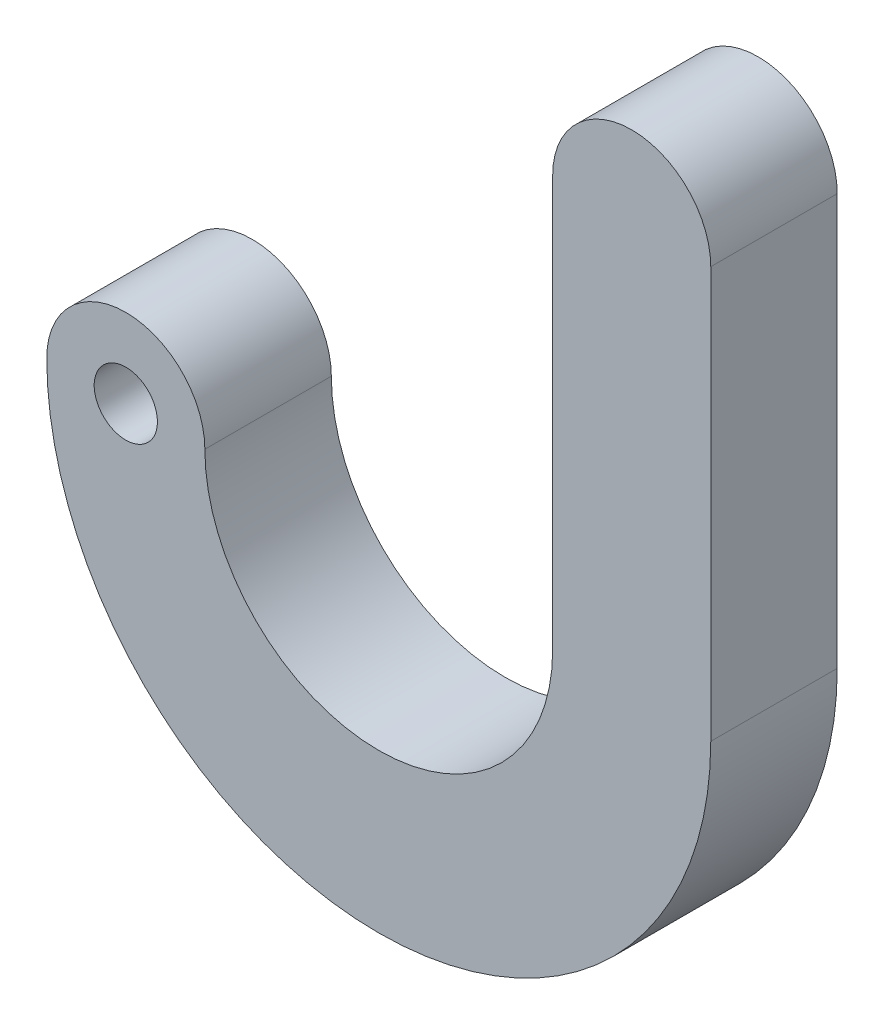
from build123d import *

# Parameters (mm, degrees)
SKETCH1_R           = 1
BOSS_EXTRUDE1_DEPTH = 4


with BuildPart() as part:
    # Sketch1 → Boss-Extrude1 (new body)
    with BuildSketch(Plane.XY):
        with BuildLine():
            Line((18.5, 0), (18.5, 13))
            ThreePointArc((18.5, 13), (16, 15.5), (13.5, 13))
            Line((13.5, 13), (13.5, 0))
            ThreePointArc((13.5, 0), (8, -5.5), (2.5, 0))
            ThreePointArc((2.5, 0), (0, 2.5), (-2.5, 0))
            ThreePointArc((-2.5, 0), (8, -10.5), (18.5, 0))
        make_face()
        Circle(SKETCH1_R, mode=Mode.SUBTRACT)
    extrude(amount=BOSS_EXTRUDE1_DEPTH)


solid = part.part
